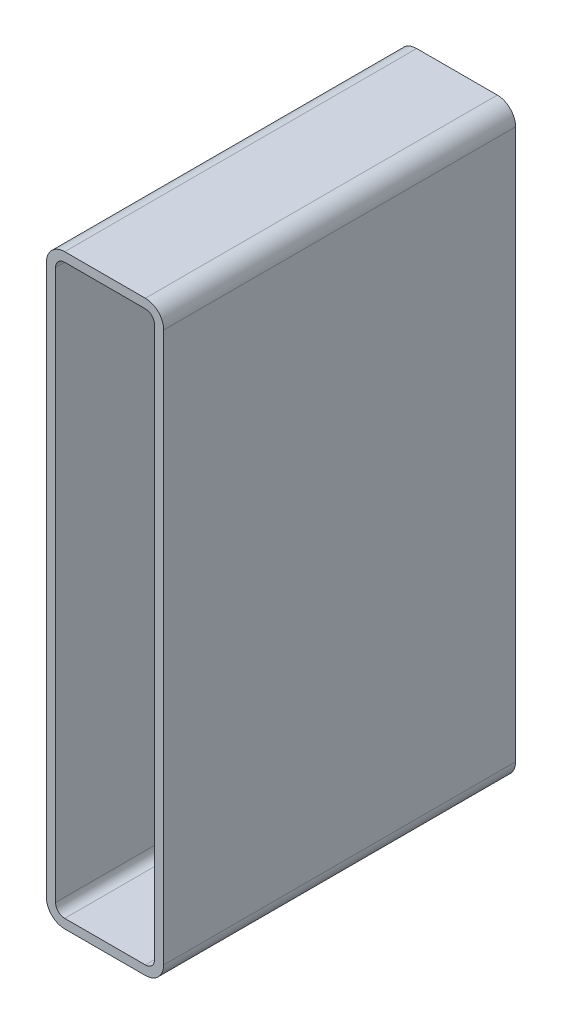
ISO-10303-21;
HEADER;
FILE_DESCRIPTION(('STEP AP214'),'2;1');
FILE_NAME('part.step','',(''),(''),'','','');
FILE_SCHEMA(('AUTOMOTIVE_DESIGN { 1 0 10303 214 1 1 1 1 }'));
ENDSEC;
DATA;
#1=APPLICATION_CONTEXT('core data for automotive mechanical design processes');
#2=APPLICATION_PROTOCOL_DEFINITION('international standard','automotive_design',2000,#1);
#3=PRODUCT_CONTEXT('',#1,'mechanical');
#4=PRODUCT('Part','Part','',(#3));
#5=PRODUCT_RELATED_PRODUCT_CATEGORY('part','',(#4));
#6=PRODUCT_DEFINITION_FORMATION('','',#4);
#7=PRODUCT_DEFINITION_CONTEXT('part definition',#1,'design');
#8=PRODUCT_DEFINITION('design','',#6,#7);
#9=PRODUCT_DEFINITION_SHAPE('','',#8);
#10=(LENGTH_UNIT() NAMED_UNIT(*) SI_UNIT(.MILLI.,.METRE.));
#11=(NAMED_UNIT(*) PLANE_ANGLE_UNIT() SI_UNIT($,.RADIAN.));
#12=(NAMED_UNIT(*) SI_UNIT($,.STERADIAN.) SOLID_ANGLE_UNIT());
#13=UNCERTAINTY_MEASURE_WITH_UNIT(LENGTH_MEASURE(1.E-05),#10,'distance_accuracy_value','');
#14=(GEOMETRIC_REPRESENTATION_CONTEXT(3) GLOBAL_UNCERTAINTY_ASSIGNED_CONTEXT((#13)) GLOBAL_UNIT_ASSIGNED_CONTEXT((#10,
#11,#12)) REPRESENTATION_CONTEXT('',''));
#15=CARTESIAN_POINT('',(0.,0.,0.));
#16=DIRECTION('',(0.,0.,1.));
#17=DIRECTION('',(1.,0.,0.));
#18=AXIS2_PLACEMENT_3D('',#15,#16,#17);
#19=CARTESIAN_POINT('',(17.5501778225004,493.816228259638,304.8));
#20=DIRECTION('',(0.,0.,1.));
#21=DIRECTION('',(1.,0.,0.));
#22=AXIS2_PLACEMENT_3D('',#19,#20,#21);
#23=PLANE('',#22);
#24=CARTESIAN_POINT('',(17.5501778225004,493.816228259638,304.8));
#25=DIRECTION('',(0.,0.,1.));
#26=DIRECTION('',(1.,0.,0.));
#27=AXIS2_PLACEMENT_3D('',#24,#25,#26);
#28=CIRCLE('',#27,15.875);
#29=CARTESIAN_POINT('',(17.5501778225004,509.691228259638,304.8));
#30=VERTEX_POINT('',#29);
#31=CARTESIAN_POINT('',(1.67517782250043,493.816228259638,304.8));
#32=VERTEX_POINT('',#31);
#33=EDGE_CURVE('E211',#30,#32,#28,.T.);
#34=ORIENTED_EDGE('',*,*,#33,.T.);
#35=DIRECTION('',(0.,-1.,0.));
#36=VECTOR('',#35,1.);
#37=CARTESIAN_POINT('',(1.67517782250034,17.566228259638,304.8));
#38=LINE('',#37,#36);
#39=CARTESIAN_POINT('',(1.67517782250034,17.5662282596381,304.8));
#40=VERTEX_POINT('',#39);
#41=EDGE_CURVE('E214',#32,#40,#38,.T.);
#42=ORIENTED_EDGE('',*,*,#41,.T.);
#43=CARTESIAN_POINT('',(17.5501778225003,17.566228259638,304.8));
#44=DIRECTION('',(0.,0.,1.));
#45=DIRECTION('',(1.,0.,0.));
#46=AXIS2_PLACEMENT_3D('',#43,#44,#45);
#47=CIRCLE('',#46,15.875);
#48=CARTESIAN_POINT('',(17.5501778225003,1.69122825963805,304.8));
#49=VERTEX_POINT('',#48);
#50=EDGE_CURVE('E217',#40,#49,#47,.T.);
#51=ORIENTED_EDGE('',*,*,#50,.T.);
#52=DIRECTION('',(1.,0.,0.));
#53=VECTOR('',#52,1.);
#54=CARTESIAN_POINT('',(87.4001778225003,1.69122825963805,304.8));
#55=LINE('',#54,#53);
#56=CARTESIAN_POINT('',(87.4001778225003,1.69122825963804,304.8));
#57=VERTEX_POINT('',#56);
#58=EDGE_CURVE('E219',#49,#57,#55,.T.);
#59=ORIENTED_EDGE('',*,*,#58,.T.);
#60=CARTESIAN_POINT('',(87.4001778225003,17.5662282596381,304.8));
#61=DIRECTION('',(0.,0.,1.));
#62=DIRECTION('',(1.,0.,0.));
#63=AXIS2_PLACEMENT_3D('',#60,#61,#62);
#64=CIRCLE('',#63,15.875);
#65=CARTESIAN_POINT('',(103.2751778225,17.566228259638,304.8));
#66=VERTEX_POINT('',#65);
#67=EDGE_CURVE('E221',#57,#66,#64,.T.);
#68=ORIENTED_EDGE('',*,*,#67,.T.);
#69=DIRECTION('',(0.,1.,0.));
#70=VECTOR('',#69,1.);
#71=CARTESIAN_POINT('',(103.2751778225,493.816228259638,304.8));
#72=LINE('',#71,#70);
#73=CARTESIAN_POINT('',(103.2751778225,493.816228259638,304.8));
#74=VERTEX_POINT('',#73);
#75=EDGE_CURVE('E223',#66,#74,#72,.T.);
#76=ORIENTED_EDGE('',*,*,#75,.T.);
#77=CARTESIAN_POINT('',(87.4001778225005,493.816228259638,304.8));
#78=DIRECTION('',(0.,0.,1.));
#79=DIRECTION('',(1.,0.,0.));
#80=AXIS2_PLACEMENT_3D('',#77,#78,#79);
#81=CIRCLE('',#80,15.875);
#82=CARTESIAN_POINT('',(87.4001778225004,509.691228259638,304.8));
#83=VERTEX_POINT('',#82);
#84=EDGE_CURVE('E225',#74,#83,#81,.T.);
#85=ORIENTED_EDGE('',*,*,#84,.T.);
#86=DIRECTION('',(-1.,0.,0.));
#87=VECTOR('',#86,1.);
#88=CARTESIAN_POINT('',(17.5501778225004,509.691228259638,304.8));
#89=LINE('',#88,#87);
#90=EDGE_CURVE('E227',#83,#30,#89,.T.);
#91=ORIENTED_EDGE('',*,*,#90,.T.);
#92=EDGE_LOOP('',(#34,#42,#51,#59,#68,#76,#85,#91));
#93=FACE_BOUND('',#92,.T.);
#94=DIRECTION('',(0.,-1.,0.));
#95=VECTOR('',#94,1.);
#96=CARTESIAN_POINT('',(9.61267782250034,17.566228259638,304.8));
#97=LINE('',#96,#95);
#98=CARTESIAN_POINT('',(9.61267782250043,493.816228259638,304.8));
#99=VERTEX_POINT('',#98);
#100=CARTESIAN_POINT('',(9.61267782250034,17.566228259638,304.8));
#101=VERTEX_POINT('',#100);
#102=EDGE_CURVE('E154',#99,#101,#97,.T.);
#103=ORIENTED_EDGE('',*,*,#102,.F.);
#104=CARTESIAN_POINT('',(17.5501778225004,493.816228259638,304.8));
#105=DIRECTION('',(0.,0.,1.));
#106=DIRECTION('',(1.,0.,0.));
#107=AXIS2_PLACEMENT_3D('',#104,#105,#106);
#108=CIRCLE('',#107,7.9375);
#109=CARTESIAN_POINT('',(17.5501778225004,501.753728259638,304.8));
#110=VERTEX_POINT('',#109);
#111=EDGE_CURVE('E146',#110,#99,#108,.T.);
#112=ORIENTED_EDGE('',*,*,#111,.F.);
#113=DIRECTION('',(-1.,0.,0.));
#114=VECTOR('',#113,1.);
#115=CARTESIAN_POINT('',(17.5501778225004,501.753728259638,304.8));
#116=LINE('',#115,#114);
#117=CARTESIAN_POINT('',(87.4001778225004,501.753728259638,304.8));
#118=VERTEX_POINT('',#117);
#119=EDGE_CURVE('E179',#118,#110,#116,.T.);
#120=ORIENTED_EDGE('',*,*,#119,.F.);
#121=CARTESIAN_POINT('',(87.4001778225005,493.816228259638,304.8));
#122=DIRECTION('',(0.,0.,1.));
#123=DIRECTION('',(1.,0.,0.));
#124=AXIS2_PLACEMENT_3D('',#121,#122,#123);
#125=CIRCLE('',#124,7.9375);
#126=CARTESIAN_POINT('',(95.3376778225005,493.816228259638,304.8));
#127=VERTEX_POINT('',#126);
#128=EDGE_CURVE('E177',#127,#118,#125,.T.);
#129=ORIENTED_EDGE('',*,*,#128,.F.);
#130=DIRECTION('',(0.,1.,0.));
#131=VECTOR('',#130,1.);
#132=CARTESIAN_POINT('',(95.3376778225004,493.816228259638,304.8));
#133=LINE('',#132,#131);
#134=CARTESIAN_POINT('',(95.3376778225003,17.566228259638,304.8));
#135=VERTEX_POINT('',#134);
#136=EDGE_CURVE('E175',#135,#127,#133,.T.);
#137=ORIENTED_EDGE('',*,*,#136,.F.);
#138=CARTESIAN_POINT('',(87.4001778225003,17.5662282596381,304.8));
#139=DIRECTION('',(0.,0.,1.));
#140=DIRECTION('',(1.,0.,0.));
#141=AXIS2_PLACEMENT_3D('',#138,#139,#140);
#142=CIRCLE('',#141,7.93750000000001);
#143=CARTESIAN_POINT('',(87.4001778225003,9.62872825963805,304.8));
#144=VERTEX_POINT('',#143);
#145=EDGE_CURVE('E173',#144,#135,#142,.T.);
#146=ORIENTED_EDGE('',*,*,#145,.F.);
#147=DIRECTION('',(1.,0.,0.));
#148=VECTOR('',#147,1.);
#149=CARTESIAN_POINT('',(87.4001778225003,9.62872825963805,304.8));
#150=LINE('',#149,#148);
#151=CARTESIAN_POINT('',(17.5501778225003,9.62872825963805,304.8));
#152=VERTEX_POINT('',#151);
#153=EDGE_CURVE('E169',#152,#144,#150,.T.);
#154=ORIENTED_EDGE('',*,*,#153,.F.);
#155=CARTESIAN_POINT('',(17.5501778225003,17.566228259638,304.8));
#156=DIRECTION('',(0.,0.,1.));
#157=DIRECTION('',(1.,0.,0.));
#158=AXIS2_PLACEMENT_3D('',#155,#156,#157);
#159=CIRCLE('',#158,7.9375);
#160=EDGE_CURVE('E167',#101,#152,#159,.T.);
#161=ORIENTED_EDGE('',*,*,#160,.F.);
#162=EDGE_LOOP('',(#103,#112,#120,#129,#137,#146,#154,#161));
#163=FACE_BOUND('',#162,.T.);
#164=ADVANCED_FACE('F33',(#93,#163),#23,.T.);
#165=CARTESIAN_POINT('',(17.5501778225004,493.816228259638,0.));
#166=DIRECTION('',(0.,0.,1.));
#167=DIRECTION('',(1.,0.,0.));
#168=AXIS2_PLACEMENT_3D('',#165,#166,#167);
#169=PLANE('',#168);
#170=CARTESIAN_POINT('',(17.5501778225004,493.816228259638,0.));
#171=DIRECTION('',(0.,0.,1.));
#172=DIRECTION('',(1.,0.,0.));
#173=AXIS2_PLACEMENT_3D('',#170,#171,#172);
#174=CIRCLE('',#173,15.875);
#175=CARTESIAN_POINT('',(17.5501778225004,509.691228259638,0.));
#176=VERTEX_POINT('',#175);
#177=CARTESIAN_POINT('',(1.67517782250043,493.816228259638,0.));
#178=VERTEX_POINT('',#177);
#179=EDGE_CURVE('E162',#176,#178,#174,.T.);
#180=ORIENTED_EDGE('',*,*,#179,.F.);
#181=DIRECTION('',(-1.,0.,0.));
#182=VECTOR('',#181,1.);
#183=CARTESIAN_POINT('',(17.5501778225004,509.691228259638,0.));
#184=LINE('',#183,#182);
#185=CARTESIAN_POINT('',(87.4001778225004,509.691228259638,0.));
#186=VERTEX_POINT('',#185);
#187=EDGE_CURVE('E215',#186,#176,#184,.T.);
#188=ORIENTED_EDGE('',*,*,#187,.F.);
#189=CARTESIAN_POINT('',(87.4001778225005,493.816228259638,0.));
#190=DIRECTION('',(0.,0.,1.));
#191=DIRECTION('',(1.,0.,0.));
#192=AXIS2_PLACEMENT_3D('',#189,#190,#191);
#193=CIRCLE('',#192,15.875);
#194=CARTESIAN_POINT('',(103.2751778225,493.816228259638,0.));
#195=VERTEX_POINT('',#194);
#196=EDGE_CURVE('E242',#195,#186,#193,.T.);
#197=ORIENTED_EDGE('',*,*,#196,.F.);
#198=DIRECTION('',(0.,1.,0.));
#199=VECTOR('',#198,1.);
#200=CARTESIAN_POINT('',(103.2751778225,493.816228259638,0.));
#201=LINE('',#200,#199);
#202=CARTESIAN_POINT('',(103.2751778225,17.566228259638,0.));
#203=VERTEX_POINT('',#202);
#204=EDGE_CURVE('E240',#203,#195,#201,.T.);
#205=ORIENTED_EDGE('',*,*,#204,.F.);
#206=CARTESIAN_POINT('',(87.4001778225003,17.5662282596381,0.));
#207=DIRECTION('',(0.,0.,1.));
#208=DIRECTION('',(1.,0.,0.));
#209=AXIS2_PLACEMENT_3D('',#206,#207,#208);
#210=CIRCLE('',#209,15.875);
#211=CARTESIAN_POINT('',(87.4001778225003,1.69122825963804,0.));
#212=VERTEX_POINT('',#211);
#213=EDGE_CURVE('E238',#212,#203,#210,.T.);
#214=ORIENTED_EDGE('',*,*,#213,.F.);
#215=DIRECTION('',(1.,0.,0.));
#216=VECTOR('',#215,1.);
#217=CARTESIAN_POINT('',(87.4001778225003,1.69122825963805,0.));
#218=LINE('',#217,#216);
#219=CARTESIAN_POINT('',(17.5501778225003,1.69122825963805,0.));
#220=VERTEX_POINT('',#219);
#221=EDGE_CURVE('E236',#220,#212,#218,.T.);
#222=ORIENTED_EDGE('',*,*,#221,.F.);
#223=CARTESIAN_POINT('',(17.5501778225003,17.566228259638,0.));
#224=DIRECTION('',(0.,0.,1.));
#225=DIRECTION('',(1.,0.,0.));
#226=AXIS2_PLACEMENT_3D('',#223,#224,#225);
#227=CIRCLE('',#226,15.875);
#228=CARTESIAN_POINT('',(1.67517782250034,17.5662282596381,0.));
#229=VERTEX_POINT('',#228);
#230=EDGE_CURVE('E234',#229,#220,#227,.T.);
#231=ORIENTED_EDGE('',*,*,#230,.F.);
#232=DIRECTION('',(0.,-1.,0.));
#233=VECTOR('',#232,1.);
#234=CARTESIAN_POINT('',(1.67517782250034,17.566228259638,0.));
#235=LINE('',#234,#233);
#236=EDGE_CURVE('E232',#178,#229,#235,.T.);
#237=ORIENTED_EDGE('',*,*,#236,.F.);
#238=EDGE_LOOP('',(#180,#188,#197,#205,#214,#222,#231,#237));
#239=FACE_BOUND('',#238,.T.);
#240=CARTESIAN_POINT('',(17.5501778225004,493.816228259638,0.));
#241=DIRECTION('',(0.,0.,1.));
#242=DIRECTION('',(1.,0.,0.));
#243=AXIS2_PLACEMENT_3D('',#240,#241,#242);
#244=CIRCLE('',#243,7.9375);
#245=CARTESIAN_POINT('',(17.5501778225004,501.753728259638,0.));
#246=VERTEX_POINT('',#245);
#247=CARTESIAN_POINT('',(9.61267782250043,493.816228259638,0.));
#248=VERTEX_POINT('',#247);
#249=EDGE_CURVE('E56',#246,#248,#244,.T.);
#250=ORIENTED_EDGE('',*,*,#249,.T.);
#251=DIRECTION('',(0.,-1.,0.));
#252=VECTOR('',#251,1.);
#253=CARTESIAN_POINT('',(9.61267782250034,17.566228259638,0.));
#254=LINE('',#253,#252);
#255=CARTESIAN_POINT('',(9.61267782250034,17.566228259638,0.));
#256=VERTEX_POINT('',#255);
#257=EDGE_CURVE('E161',#248,#256,#254,.T.);
#258=ORIENTED_EDGE('',*,*,#257,.T.);
#259=CARTESIAN_POINT('',(17.5501778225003,17.566228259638,0.));
#260=DIRECTION('',(0.,0.,1.));
#261=DIRECTION('',(1.,0.,0.));
#262=AXIS2_PLACEMENT_3D('',#259,#260,#261);
#263=CIRCLE('',#262,7.9375);
#264=CARTESIAN_POINT('',(17.5501778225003,9.62872825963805,0.));
#265=VERTEX_POINT('',#264);
#266=EDGE_CURVE('E183',#256,#265,#263,.T.);
#267=ORIENTED_EDGE('',*,*,#266,.T.);
#268=DIRECTION('',(1.,0.,0.));
#269=VECTOR('',#268,1.);
#270=CARTESIAN_POINT('',(87.4001778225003,9.62872825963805,0.));
#271=LINE('',#270,#269);
#272=CARTESIAN_POINT('',(87.4001778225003,9.62872825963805,0.));
#273=VERTEX_POINT('',#272);
#274=EDGE_CURVE('E186',#265,#273,#271,.T.);
#275=ORIENTED_EDGE('',*,*,#274,.T.);
#276=CARTESIAN_POINT('',(87.4001778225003,17.5662282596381,0.));
#277=DIRECTION('',(0.,0.,1.));
#278=DIRECTION('',(1.,0.,0.));
#279=AXIS2_PLACEMENT_3D('',#276,#277,#278);
#280=CIRCLE('',#279,7.93750000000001);
#281=CARTESIAN_POINT('',(95.3376778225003,17.566228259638,0.));
#282=VERTEX_POINT('',#281);
#283=EDGE_CURVE('E189',#273,#282,#280,.T.);
#284=ORIENTED_EDGE('',*,*,#283,.T.);
#285=DIRECTION('',(0.,1.,0.));
#286=VECTOR('',#285,1.);
#287=CARTESIAN_POINT('',(95.3376778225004,493.816228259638,0.));
#288=LINE('',#287,#286);
#289=CARTESIAN_POINT('',(95.3376778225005,493.816228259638,0.));
#290=VERTEX_POINT('',#289);
#291=EDGE_CURVE('E192',#282,#290,#288,.T.);
#292=ORIENTED_EDGE('',*,*,#291,.T.);
#293=CARTESIAN_POINT('',(87.4001778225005,493.816228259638,0.));
#294=DIRECTION('',(0.,0.,1.));
#295=DIRECTION('',(1.,0.,0.));
#296=AXIS2_PLACEMENT_3D('',#293,#294,#295);
#297=CIRCLE('',#296,7.9375);
#298=CARTESIAN_POINT('',(87.4001778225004,501.753728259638,0.));
#299=VERTEX_POINT('',#298);
#300=EDGE_CURVE('E195',#290,#299,#297,.T.);
#301=ORIENTED_EDGE('',*,*,#300,.T.);
#302=DIRECTION('',(-1.,0.,0.));
#303=VECTOR('',#302,1.);
#304=CARTESIAN_POINT('',(17.5501778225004,501.753728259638,0.));
#305=LINE('',#304,#303);
#306=EDGE_CURVE('E155',#299,#246,#305,.T.);
#307=ORIENTED_EDGE('',*,*,#306,.T.);
#308=EDGE_LOOP('',(#250,#258,#267,#275,#284,#292,#301,#307));
#309=FACE_BOUND('',#308,.T.);
#310=ADVANCED_FACE('F272',(#239,#309),#169,.F.);
#311=CARTESIAN_POINT('',(17.5501778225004,493.816228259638,304.8));
#312=DIRECTION('',(0.,0.,-1.));
#313=DIRECTION('',(-1.,0.,0.));
#314=AXIS2_PLACEMENT_3D('',#311,#312,#313);
#315=CYLINDRICAL_SURFACE('',#314,15.875);
#316=ORIENTED_EDGE('',*,*,#179,.T.);
#317=DIRECTION('',(0.,0.,-1.));
#318=VECTOR('',#317,1.);
#319=CARTESIAN_POINT('',(1.67517782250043,493.816228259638,304.8));
#320=LINE('',#319,#318);
#321=EDGE_CURVE('E11',#32,#178,#320,.T.);
#322=ORIENTED_EDGE('',*,*,#321,.F.);
#323=ORIENTED_EDGE('',*,*,#33,.F.);
#324=DIRECTION('',(0.,0.,-1.));
#325=VECTOR('',#324,1.);
#326=CARTESIAN_POINT('',(17.5501778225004,509.691228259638,304.8));
#327=LINE('',#326,#325);
#328=EDGE_CURVE('E229',#30,#176,#327,.T.);
#329=ORIENTED_EDGE('',*,*,#328,.T.);
#330=EDGE_LOOP('',(#316,#322,#323,#329));
#331=FACE_BOUND('',#330,.T.);
#332=ADVANCED_FACE('F35',(#331),#315,.T.);
#333=CARTESIAN_POINT('',(1.67517782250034,17.566228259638,304.8));
#334=DIRECTION('',(1.,0.,0.));
#335=DIRECTION('',(0.,1.,0.));
#336=AXIS2_PLACEMENT_3D('',#333,#334,#335);
#337=PLANE('',#336);
#338=ORIENTED_EDGE('',*,*,#236,.T.);
#339=DIRECTION('',(0.,0.,-1.));
#340=VECTOR('',#339,1.);
#341=CARTESIAN_POINT('',(1.67517782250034,17.5662282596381,304.8));
#342=LINE('',#341,#340);
#343=EDGE_CURVE('E41',#40,#229,#342,.T.);
#344=ORIENTED_EDGE('',*,*,#343,.F.);
#345=ORIENTED_EDGE('',*,*,#41,.F.);
#346=ORIENTED_EDGE('',*,*,#321,.T.);
#347=EDGE_LOOP('',(#338,#344,#345,#346));
#348=FACE_BOUND('',#347,.T.);
#349=ADVANCED_FACE('F289',(#348),#337,.F.);
#350=CARTESIAN_POINT('',(17.5501778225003,17.566228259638,304.8));
#351=DIRECTION('',(0.,0.,-1.));
#352=DIRECTION('',(-1.,0.,0.));
#353=AXIS2_PLACEMENT_3D('',#350,#351,#352);
#354=CYLINDRICAL_SURFACE('',#353,15.875);
#355=ORIENTED_EDGE('',*,*,#230,.T.);
#356=DIRECTION('',(0.,0.,-1.));
#357=VECTOR('',#356,1.);
#358=CARTESIAN_POINT('',(17.5501778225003,1.69122825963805,304.8));
#359=LINE('',#358,#357);
#360=EDGE_CURVE('E259',#49,#220,#359,.T.);
#361=ORIENTED_EDGE('',*,*,#360,.F.);
#362=ORIENTED_EDGE('',*,*,#50,.F.);
#363=ORIENTED_EDGE('',*,*,#343,.T.);
#364=EDGE_LOOP('',(#355,#361,#362,#363));
#365=FACE_BOUND('',#364,.T.);
#366=ADVANCED_FACE('F266',(#365),#354,.T.);
#367=CARTESIAN_POINT('',(87.4001778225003,1.69122825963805,304.8));
#368=DIRECTION('',(0.,1.,0.));
#369=DIRECTION('',(0.,0.,1.));
#370=AXIS2_PLACEMENT_3D('',#367,#368,#369);
#371=PLANE('',#370);
#372=ORIENTED_EDGE('',*,*,#221,.T.);
#373=DIRECTION('',(0.,0.,-1.));
#374=VECTOR('',#373,1.);
#375=CARTESIAN_POINT('',(87.4001778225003,1.69122825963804,304.8));
#376=LINE('',#375,#374);
#377=EDGE_CURVE('E256',#57,#212,#376,.T.);
#378=ORIENTED_EDGE('',*,*,#377,.F.);
#379=ORIENTED_EDGE('',*,*,#58,.F.);
#380=ORIENTED_EDGE('',*,*,#360,.T.);
#381=EDGE_LOOP('',(#372,#378,#379,#380));
#382=FACE_BOUND('',#381,.T.);
#383=ADVANCED_FACE('F278',(#382),#371,.F.);
#384=CARTESIAN_POINT('',(87.4001778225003,17.5662282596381,304.8));
#385=DIRECTION('',(0.,0.,-1.));
#386=DIRECTION('',(-1.,0.,0.));
#387=AXIS2_PLACEMENT_3D('',#384,#385,#386);
#388=CYLINDRICAL_SURFACE('',#387,15.875);
#389=ORIENTED_EDGE('',*,*,#213,.T.);
#390=DIRECTION('',(0.,0.,-1.));
#391=VECTOR('',#390,1.);
#392=CARTESIAN_POINT('',(103.2751778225,17.566228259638,304.8));
#393=LINE('',#392,#391);
#394=EDGE_CURVE('E253',#66,#203,#393,.T.);
#395=ORIENTED_EDGE('',*,*,#394,.F.);
#396=ORIENTED_EDGE('',*,*,#67,.F.);
#397=ORIENTED_EDGE('',*,*,#377,.T.);
#398=EDGE_LOOP('',(#389,#395,#396,#397));
#399=FACE_BOUND('',#398,.T.);
#400=ADVANCED_FACE('F282',(#399),#388,.T.);
#401=CARTESIAN_POINT('',(103.2751778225,493.816228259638,304.8));
#402=DIRECTION('',(-1.,0.,0.));
#403=DIRECTION('',(0.,-1.,0.));
#404=AXIS2_PLACEMENT_3D('',#401,#402,#403);
#405=PLANE('',#404);
#406=ORIENTED_EDGE('',*,*,#204,.T.);
#407=DIRECTION('',(0.,0.,-1.));
#408=VECTOR('',#407,1.);
#409=CARTESIAN_POINT('',(103.2751778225,493.816228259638,304.8));
#410=LINE('',#409,#408);
#411=EDGE_CURVE('E250',#74,#195,#410,.T.);
#412=ORIENTED_EDGE('',*,*,#411,.F.);
#413=ORIENTED_EDGE('',*,*,#75,.F.);
#414=ORIENTED_EDGE('',*,*,#394,.T.);
#415=EDGE_LOOP('',(#406,#412,#413,#414));
#416=FACE_BOUND('',#415,.T.);
#417=ADVANCED_FACE('F302',(#416),#405,.F.);
#418=CARTESIAN_POINT('',(87.4001778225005,493.816228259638,304.8));
#419=DIRECTION('',(0.,0.,-1.));
#420=DIRECTION('',(-1.,0.,0.));
#421=AXIS2_PLACEMENT_3D('',#418,#419,#420);
#422=CYLINDRICAL_SURFACE('',#421,15.875);
#423=ORIENTED_EDGE('',*,*,#196,.T.);
#424=DIRECTION('',(0.,0.,-1.));
#425=VECTOR('',#424,1.);
#426=CARTESIAN_POINT('',(87.4001778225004,509.691228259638,304.8));
#427=LINE('',#426,#425);
#428=EDGE_CURVE('E247',#83,#186,#427,.T.);
#429=ORIENTED_EDGE('',*,*,#428,.F.);
#430=ORIENTED_EDGE('',*,*,#84,.F.);
#431=ORIENTED_EDGE('',*,*,#411,.T.);
#432=EDGE_LOOP('',(#423,#429,#430,#431));
#433=FACE_BOUND('',#432,.T.);
#434=ADVANCED_FACE('F300',(#433),#422,.T.);
#435=CARTESIAN_POINT('',(17.5501778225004,509.691228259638,304.8));
#436=DIRECTION('',(0.,-1.,0.));
#437=DIRECTION('',(0.,0.,-1.));
#438=AXIS2_PLACEMENT_3D('',#435,#436,#437);
#439=PLANE('',#438);
#440=ORIENTED_EDGE('',*,*,#187,.T.);
#441=ORIENTED_EDGE('',*,*,#328,.F.);
#442=ORIENTED_EDGE('',*,*,#90,.F.);
#443=ORIENTED_EDGE('',*,*,#428,.T.);
#444=EDGE_LOOP('',(#440,#441,#442,#443));
#445=FACE_BOUND('',#444,.T.);
#446=ADVANCED_FACE('F295',(#445),#439,.F.);
#447=CARTESIAN_POINT('',(17.5501778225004,493.816228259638,304.8));
#448=DIRECTION('',(0.,0.,-1.));
#449=DIRECTION('',(-1.,0.,0.));
#450=AXIS2_PLACEMENT_3D('',#447,#448,#449);
#451=CYLINDRICAL_SURFACE('',#450,7.9375);
#452=ORIENTED_EDGE('',*,*,#249,.F.);
#453=DIRECTION('',(0.,0.,-1.));
#454=VECTOR('',#453,1.);
#455=CARTESIAN_POINT('',(17.5501778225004,501.753728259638,304.8));
#456=LINE('',#455,#454);
#457=EDGE_CURVE('E150',#110,#246,#456,.T.);
#458=ORIENTED_EDGE('',*,*,#457,.F.);
#459=ORIENTED_EDGE('',*,*,#111,.T.);
#460=DIRECTION('',(0.,0.,-1.));
#461=VECTOR('',#460,1.);
#462=CARTESIAN_POINT('',(9.61267782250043,493.816228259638,304.8));
#463=LINE('',#462,#461);
#464=EDGE_CURVE('E149',#99,#248,#463,.T.);
#465=ORIENTED_EDGE('',*,*,#464,.T.);
#466=EDGE_LOOP('',(#452,#458,#459,#465));
#467=FACE_BOUND('',#466,.T.);
#468=ADVANCED_FACE('F148',(#467),#451,.F.);
#469=CARTESIAN_POINT('',(9.61267782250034,17.566228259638,304.8));
#470=DIRECTION('',(1.,0.,0.));
#471=DIRECTION('',(0.,1.,0.));
#472=AXIS2_PLACEMENT_3D('',#469,#470,#471);
#473=PLANE('',#472);
#474=ORIENTED_EDGE('',*,*,#257,.F.);
#475=ORIENTED_EDGE('',*,*,#464,.F.);
#476=ORIENTED_EDGE('',*,*,#102,.T.);
#477=DIRECTION('',(0.,0.,-1.));
#478=VECTOR('',#477,1.);
#479=CARTESIAN_POINT('',(9.61267782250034,17.566228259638,304.8));
#480=LINE('',#479,#478);
#481=EDGE_CURVE('E163',#101,#256,#480,.T.);
#482=ORIENTED_EDGE('',*,*,#481,.T.);
#483=EDGE_LOOP('',(#474,#475,#476,#482));
#484=FACE_BOUND('',#483,.T.);
#485=ADVANCED_FACE('F158',(#484),#473,.T.);
#486=CARTESIAN_POINT('',(17.5501778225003,17.566228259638,304.8));
#487=DIRECTION('',(0.,0.,-1.));
#488=DIRECTION('',(-1.,0.,0.));
#489=AXIS2_PLACEMENT_3D('',#486,#487,#488);
#490=CYLINDRICAL_SURFACE('',#489,7.9375);
#491=ORIENTED_EDGE('',*,*,#266,.F.);
#492=ORIENTED_EDGE('',*,*,#481,.F.);
#493=ORIENTED_EDGE('',*,*,#160,.T.);
#494=DIRECTION('',(0.,0.,-1.));
#495=VECTOR('',#494,1.);
#496=CARTESIAN_POINT('',(17.5501778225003,9.62872825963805,304.8));
#497=LINE('',#496,#495);
#498=EDGE_CURVE('E208',#152,#265,#497,.T.);
#499=ORIENTED_EDGE('',*,*,#498,.T.);
#500=EDGE_LOOP('',(#491,#492,#493,#499));
#501=FACE_BOUND('',#500,.T.);
#502=ADVANCED_FACE('F327',(#501),#490,.F.);
#503=CARTESIAN_POINT('',(87.4001778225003,9.62872825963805,304.8));
#504=DIRECTION('',(0.,1.,0.));
#505=DIRECTION('',(0.,0.,1.));
#506=AXIS2_PLACEMENT_3D('',#503,#504,#505);
#507=PLANE('',#506);
#508=ORIENTED_EDGE('',*,*,#274,.F.);
#509=ORIENTED_EDGE('',*,*,#498,.F.);
#510=ORIENTED_EDGE('',*,*,#153,.T.);
#511=DIRECTION('',(0.,0.,-1.));
#512=VECTOR('',#511,1.);
#513=CARTESIAN_POINT('',(87.4001778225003,9.62872825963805,304.8));
#514=LINE('',#513,#512);
#515=EDGE_CURVE('E206',#144,#273,#514,.T.);
#516=ORIENTED_EDGE('',*,*,#515,.T.);
#517=EDGE_LOOP('',(#508,#509,#510,#516));
#518=FACE_BOUND('',#517,.T.);
#519=ADVANCED_FACE('F331',(#518),#507,.T.);
#520=CARTESIAN_POINT('',(87.4001778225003,17.5662282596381,304.8));
#521=DIRECTION('',(0.,0.,-1.));
#522=DIRECTION('',(-1.,0.,0.));
#523=AXIS2_PLACEMENT_3D('',#520,#521,#522);
#524=CYLINDRICAL_SURFACE('',#523,7.93750000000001);
#525=ORIENTED_EDGE('',*,*,#283,.F.);
#526=ORIENTED_EDGE('',*,*,#515,.F.);
#527=ORIENTED_EDGE('',*,*,#145,.T.);
#528=DIRECTION('',(0.,0.,-1.));
#529=VECTOR('',#528,1.);
#530=CARTESIAN_POINT('',(95.3376778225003,17.566228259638,304.8));
#531=LINE('',#530,#529);
#532=EDGE_CURVE('E204',#135,#282,#531,.T.);
#533=ORIENTED_EDGE('',*,*,#532,.T.);
#534=EDGE_LOOP('',(#525,#526,#527,#533));
#535=FACE_BOUND('',#534,.T.);
#536=ADVANCED_FACE('F337',(#535),#524,.F.);
#537=CARTESIAN_POINT('',(95.3376778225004,493.816228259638,304.8));
#538=DIRECTION('',(-1.,0.,0.));
#539=DIRECTION('',(0.,-1.,0.));
#540=AXIS2_PLACEMENT_3D('',#537,#538,#539);
#541=PLANE('',#540);
#542=ORIENTED_EDGE('',*,*,#291,.F.);
#543=ORIENTED_EDGE('',*,*,#532,.F.);
#544=ORIENTED_EDGE('',*,*,#136,.T.);
#545=DIRECTION('',(0.,0.,-1.));
#546=VECTOR('',#545,1.);
#547=CARTESIAN_POINT('',(95.3376778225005,493.816228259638,304.8));
#548=LINE('',#547,#546);
#549=EDGE_CURVE('E202',#127,#290,#548,.T.);
#550=ORIENTED_EDGE('',*,*,#549,.T.);
#551=EDGE_LOOP('',(#542,#543,#544,#550));
#552=FACE_BOUND('',#551,.T.);
#553=ADVANCED_FACE('F341',(#552),#541,.T.);
#554=CARTESIAN_POINT('',(87.4001778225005,493.816228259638,304.8));
#555=DIRECTION('',(0.,0.,-1.));
#556=DIRECTION('',(-1.,0.,0.));
#557=AXIS2_PLACEMENT_3D('',#554,#555,#556);
#558=CYLINDRICAL_SURFACE('',#557,7.9375);
#559=ORIENTED_EDGE('',*,*,#300,.F.);
#560=ORIENTED_EDGE('',*,*,#549,.F.);
#561=ORIENTED_EDGE('',*,*,#128,.T.);
#562=DIRECTION('',(0.,0.,-1.));
#563=VECTOR('',#562,1.);
#564=CARTESIAN_POINT('',(87.4001778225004,501.753728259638,304.8));
#565=LINE('',#564,#563);
#566=EDGE_CURVE('E48',#118,#299,#565,.T.);
#567=ORIENTED_EDGE('',*,*,#566,.T.);
#568=EDGE_LOOP('',(#559,#560,#561,#567));
#569=FACE_BOUND('',#568,.T.);
#570=ADVANCED_FACE('F345',(#569),#558,.F.);
#571=CARTESIAN_POINT('',(17.5501778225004,501.753728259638,304.8));
#572=DIRECTION('',(0.,-1.,0.));
#573=DIRECTION('',(0.,0.,-1.));
#574=AXIS2_PLACEMENT_3D('',#571,#572,#573);
#575=PLANE('',#574);
#576=ORIENTED_EDGE('',*,*,#306,.F.);
#577=ORIENTED_EDGE('',*,*,#566,.F.);
#578=ORIENTED_EDGE('',*,*,#119,.T.);
#579=ORIENTED_EDGE('',*,*,#457,.T.);
#580=EDGE_LOOP('',(#576,#577,#578,#579));
#581=FACE_BOUND('',#580,.T.);
#582=ADVANCED_FACE('F349',(#581),#575,.T.);
#583=CLOSED_SHELL('',(#164,#310,#332,#349,#366,#383,#400,#417,#434,#446,#468,#485,#502,#519,
#536,#553,#570,#582));
#584=MANIFOLD_SOLID_BREP('B2',#583);
#585=ADVANCED_BREP_SHAPE_REPRESENTATION('',(#18,#584),#14);
#586=SHAPE_DEFINITION_REPRESENTATION(#9,#585);
ENDSEC;
END-ISO-10303-21;
